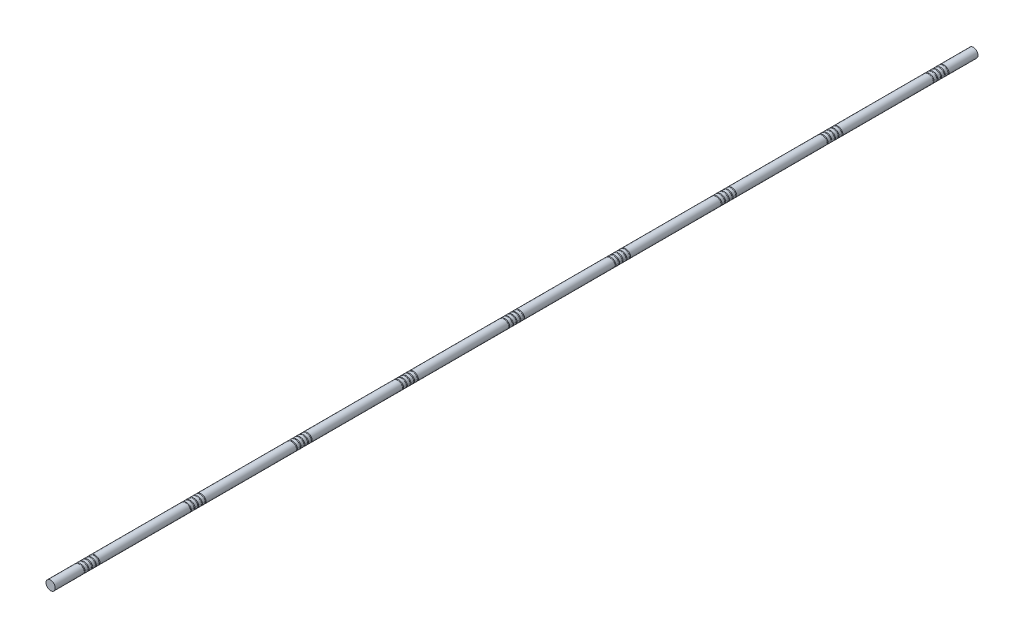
from build123d import *

# Parameters (mm, degrees)
SKETCH1_R              = 25
BOSS_EXTRUDE1_DEPTH    = 5000
CUT_SWEEP1_PITCH       = 20
CUT_SWEEP1_HEIGHT      = 100
CUT_SWEEP1_RADIUS      = 27.116666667
CUT_SWEEP1_START_ANGLE = -180
SKETCH3_R              = 3.175
LPATTERN1_COUNT        = 9
LPATTERN1_PITCH        = 575


with BuildPart() as part:
    # Sketch1 → Boss-Extrude1 (new body)
    with BuildSketch(Plane.XY):
        Circle(SKETCH1_R)
    extrude(amount=BOSS_EXTRUDE1_DEPTH)

    # Cut-Sweep1: sweep along a helix
    with BuildLine() as cut_sweep1_path:
        add(Helix(CUT_SWEEP1_PITCH, CUT_SWEEP1_HEIGHT, CUT_SWEEP1_RADIUS, center=(0, 0, 150), direction=(0, 0, 1), mode=Mode.PRIVATE).rotate(Axis((0, 0, 150), (0, 0, 1)), CUT_SWEEP1_START_ANGLE))
    # Sketch3 → Cut-Sweep1 (sweep, cut)
    with BuildSketch(Plane(origin=(0, 0, 0), x_dir=(1, 0, 0), z_dir=(0, 1, 0))):
        with Locations((-27.116666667, -150)):
            Circle(SKETCH3_R)
    cut_sweep1 = sweep(path=cut_sweep1_path.line, is_frenet=True, mode=Mode.SUBTRACT)

    # LPattern1: Cut-Sweep1 ×9
    with Locations(*[(0, 0, i * LPATTERN1_PITCH) for i in range(1, LPATTERN1_COUNT)]):
        add(cut_sweep1, mode=Mode.SUBTRACT)


solid = part.part
